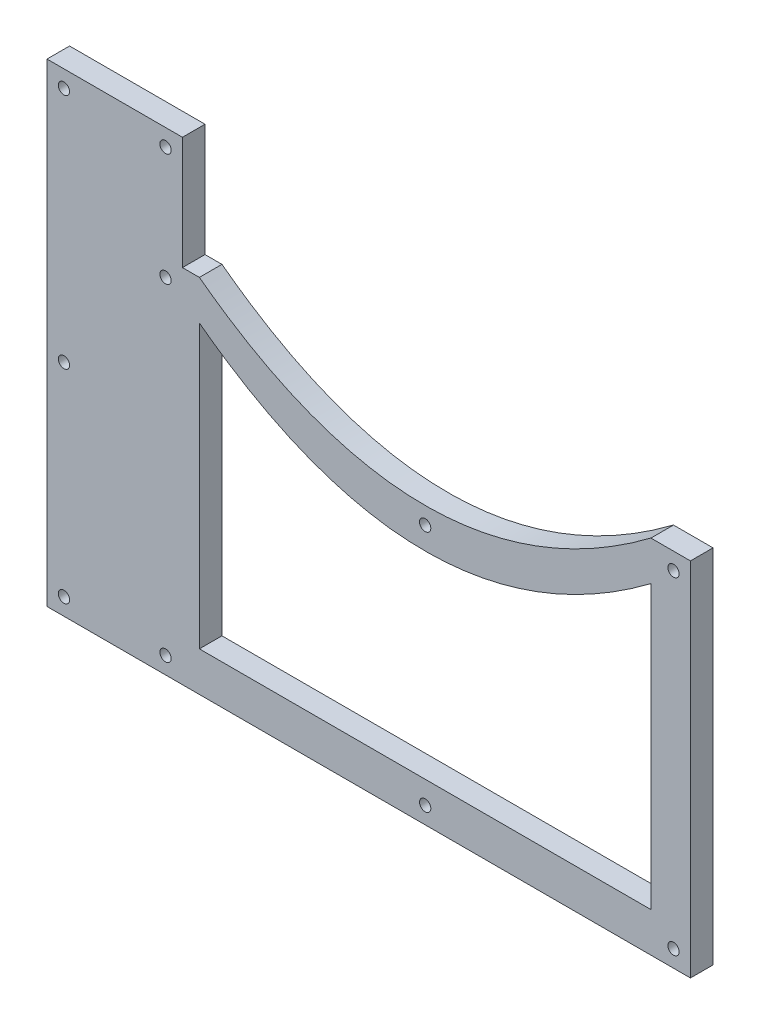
from build123d import *

# Parameters (mm, degrees)
SKETCH_1_R      = 1
EXTRUDE_2_DEPTH = 4


with BuildPart() as part:
    # Sketch 1 → Extrude 2 (new body)
    with BuildSketch(Plane.XY):
        with BuildLine():
            Line((24, 64), (27, 64))
            add(Edge.make_bspline(
                [(27, 64), (67, 34), (107, 64)],
                knots=[0, 0, 0, 1, 1, 1], degree=2))
            Line((107, 64), (114, 64))
            Line((114, 64), (114, 0))
            Line((114, 0), (0, 0))
            Line((0, 0), (0, 84))
            Line((0, 84), (24, 84))
            Line((24, 84), (24, 64))
        make_face()
        with Locations((3, 81)):
            Circle(SKETCH_1_R, mode=Mode.SUBTRACT)
        with Locations((21, 81)):
            Circle(SKETCH_1_R, mode=Mode.SUBTRACT)
        with Locations((21, 61)):
            Circle(SKETCH_1_R, mode=Mode.SUBTRACT)
        with Locations((3, 39)):
            Circle(SKETCH_1_R, mode=Mode.SUBTRACT)
        with Locations((3, 3)):
            Circle(SKETCH_1_R, mode=Mode.SUBTRACT)
        with Locations((21, 3)):
            Circle(SKETCH_1_R, mode=Mode.SUBTRACT)
        with Locations((67, 3)):
            Circle(SKETCH_1_R, mode=Mode.SUBTRACT)
        with Locations((111, 3)):
            Circle(SKETCH_1_R, mode=Mode.SUBTRACT)
        with Locations((111, 61)):
            Circle(SKETCH_1_R, mode=Mode.SUBTRACT)
        with Locations((67, 46)):
            Circle(SKETCH_1_R, mode=Mode.SUBTRACT)
        with BuildLine():
            Line((107, 7), (107, 57))
            add(Edge.make_bspline(
                [(27, 57), (67, 27), (107, 57)],
                knots=[0, 0, 0, 1, 1, 1], degree=2))
            Line((27, 57), (27, 7))
            Line((27, 7), (107, 7))
        make_face(mode=Mode.SUBTRACT)
    extrude(amount=EXTRUDE_2_DEPTH)


solid = part.part
